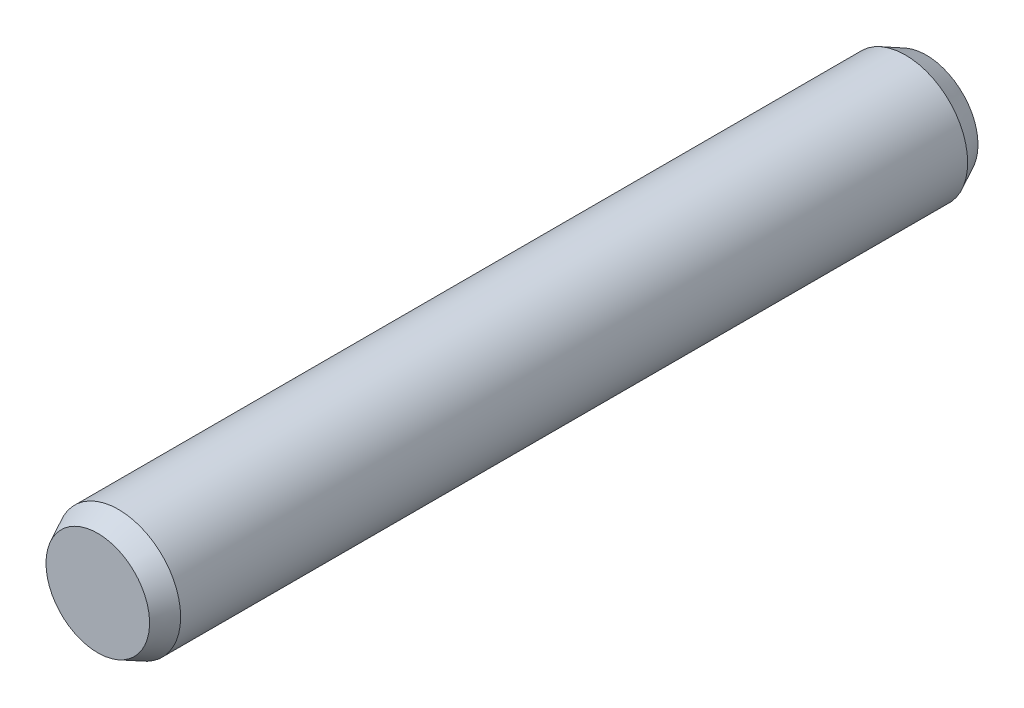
ISO-10303-21;
HEADER;
FILE_DESCRIPTION(('STEP AP214'),'2;1');
FILE_NAME('part.step','',(''),(''),'','','');
FILE_SCHEMA(('AUTOMOTIVE_DESIGN { 1 0 10303 214 1 1 1 1 }'));
ENDSEC;
DATA;
#1=APPLICATION_CONTEXT('core data for automotive mechanical design processes');
#2=APPLICATION_PROTOCOL_DEFINITION('international standard','automotive_design',2000,#1);
#3=PRODUCT_CONTEXT('',#1,'mechanical');
#4=PRODUCT('Part','Part','',(#3));
#5=PRODUCT_RELATED_PRODUCT_CATEGORY('part','',(#4));
#6=PRODUCT_DEFINITION_FORMATION('','',#4);
#7=PRODUCT_DEFINITION_CONTEXT('part definition',#1,'design');
#8=PRODUCT_DEFINITION('design','',#6,#7);
#9=PRODUCT_DEFINITION_SHAPE('','',#8);
#10=(LENGTH_UNIT() NAMED_UNIT(*) SI_UNIT(.MILLI.,.METRE.));
#11=(NAMED_UNIT(*) PLANE_ANGLE_UNIT() SI_UNIT($,.RADIAN.));
#12=(NAMED_UNIT(*) SI_UNIT($,.STERADIAN.) SOLID_ANGLE_UNIT());
#13=UNCERTAINTY_MEASURE_WITH_UNIT(LENGTH_MEASURE(1.E-05),#10,'distance_accuracy_value','');
#14=(GEOMETRIC_REPRESENTATION_CONTEXT(3) GLOBAL_UNCERTAINTY_ASSIGNED_CONTEXT((#13)) GLOBAL_UNIT_ASSIGNED_CONTEXT((#10,
#11,#12)) REPRESENTATION_CONTEXT('',''));
#15=CARTESIAN_POINT('',(0.,0.,0.));
#16=DIRECTION('',(0.,0.,1.));
#17=DIRECTION('',(1.,0.,0.));
#18=AXIS2_PLACEMENT_3D('',#15,#16,#17);
#19=CARTESIAN_POINT('',(0.,0.,20.));
#20=DIRECTION('',(0.,0.,-1.));
#21=DIRECTION('',(-1.,0.,0.));
#22=AXIS2_PLACEMENT_3D('',#19,#20,#21);
#23=PLANE('',#22);
#24=CARTESIAN_POINT('',(0.,0.,20.0000000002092));
#25=DIRECTION('',(0.,0.,-1.));
#26=DIRECTION('',(-1.,0.,0.));
#27=AXIS2_PLACEMENT_3D('',#24,#25,#26);
#28=CIRCLE('',#27,2.50000000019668);
#29=CARTESIAN_POINT('',(-2.50000000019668,0.,20.0000000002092));
#30=VERTEX_POINT('',#29);
#31=EDGE_CURVE('E17',#30,#30,#28,.T.);
#32=ORIENTED_EDGE('',*,*,#31,.F.);
#33=EDGE_LOOP('',(#32));
#34=FACE_BOUND('',#33,.T.);
#35=ADVANCED_FACE('F14',(#34),#23,.F.);
#36=CARTESIAN_POINT('',(0.,0.,-20.));
#37=DIRECTION('',(0.,0.,-1.));
#38=DIRECTION('',(-1.,0.,0.));
#39=AXIS2_PLACEMENT_3D('',#36,#37,#38);
#40=PLANE('',#39);
#41=CARTESIAN_POINT('',(0.,0.,-20.0000000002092));
#42=DIRECTION('',(0.,0.,1.));
#43=DIRECTION('',(1.,0.,0.));
#44=AXIS2_PLACEMENT_3D('',#41,#42,#43);
#45=CIRCLE('',#44,2.50000000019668);
#46=CARTESIAN_POINT('',(2.50000000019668,0.,-20.0000000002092));
#47=VERTEX_POINT('',#46);
#48=EDGE_CURVE('E26',#47,#47,#45,.T.);
#49=ORIENTED_EDGE('',*,*,#48,.F.);
#50=EDGE_LOOP('',(#49));
#51=FACE_BOUND('',#50,.T.);
#52=ADVANCED_FACE('F41',(#51),#40,.T.);
#53=CARTESIAN_POINT('',(0.,0.,19.0000000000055));
#54=DIRECTION('',(0.,0.,-1.));
#55=DIRECTION('',(-1.,0.,0.));
#56=AXIS2_PLACEMENT_3D('',#53,#54,#55);
#57=CONICAL_SURFACE('',#56,2.99999999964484,0.463647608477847);
#58=CARTESIAN_POINT('',(0.,0.,19.));
#59=DIRECTION('',(0.,0.,1.));
#60=DIRECTION('',(1.,0.,0.));
#61=AXIS2_PLACEMENT_3D('',#58,#59,#60);
#62=CIRCLE('',#61,3.);
#63=CARTESIAN_POINT('',(3.,0.,19.));
#64=VERTEX_POINT('',#63);
#65=EDGE_CURVE('E21',#64,#64,#62,.F.);
#66=ORIENTED_EDGE('',*,*,#65,.F.);
#67=EDGE_LOOP('',(#66));
#68=FACE_BOUND('',#67,.T.);
#69=ORIENTED_EDGE('',*,*,#31,.T.);
#70=EDGE_LOOP('',(#69));
#71=FACE_BOUND('',#70,.T.);
#72=ADVANCED_FACE('F38',(#68,#71),#57,.T.);
#73=CARTESIAN_POINT('',(0.,0.,-19.0000000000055));
#74=DIRECTION('',(0.,0.,1.));
#75=DIRECTION('',(1.,0.,0.));
#76=AXIS2_PLACEMENT_3D('',#73,#74,#75);
#77=CONICAL_SURFACE('',#76,2.99999999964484,0.463647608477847);
#78=CARTESIAN_POINT('',(0.,0.,-19.));
#79=DIRECTION('',(0.,0.,1.));
#80=DIRECTION('',(1.,0.,0.));
#81=AXIS2_PLACEMENT_3D('',#78,#79,#80);
#82=CIRCLE('',#81,3.);
#83=CARTESIAN_POINT('',(3.,0.,-19.));
#84=VERTEX_POINT('',#83);
#85=EDGE_CURVE('E10',#84,#84,#82,.T.);
#86=ORIENTED_EDGE('',*,*,#85,.F.);
#87=EDGE_LOOP('',(#86));
#88=FACE_BOUND('',#87,.T.);
#89=ORIENTED_EDGE('',*,*,#48,.T.);
#90=EDGE_LOOP('',(#89));
#91=FACE_BOUND('',#90,.T.);
#92=ADVANCED_FACE('F49',(#88,#91),#77,.T.);
#93=CARTESIAN_POINT('',(0.,0.,0.));
#94=DIRECTION('',(0.,0.,1.));
#95=DIRECTION('',(1.,0.,0.));
#96=AXIS2_PLACEMENT_3D('',#93,#94,#95);
#97=CYLINDRICAL_SURFACE('',#96,3.);
#98=ORIENTED_EDGE('',*,*,#85,.T.);
#99=EDGE_LOOP('',(#98));
#100=FACE_BOUND('',#99,.T.);
#101=ORIENTED_EDGE('',*,*,#65,.T.);
#102=EDGE_LOOP('',(#101));
#103=FACE_BOUND('',#102,.T.);
#104=ADVANCED_FACE('F47',(#100,#103),#97,.T.);
#105=CLOSED_SHELL('',(#35,#52,#72,#92,#104));
#106=MANIFOLD_SOLID_BREP('B1',#105);
#107=ADVANCED_BREP_SHAPE_REPRESENTATION('',(#18,#106),#14);
#108=SHAPE_DEFINITION_REPRESENTATION(#9,#107);
ENDSEC;
END-ISO-10303-21;
